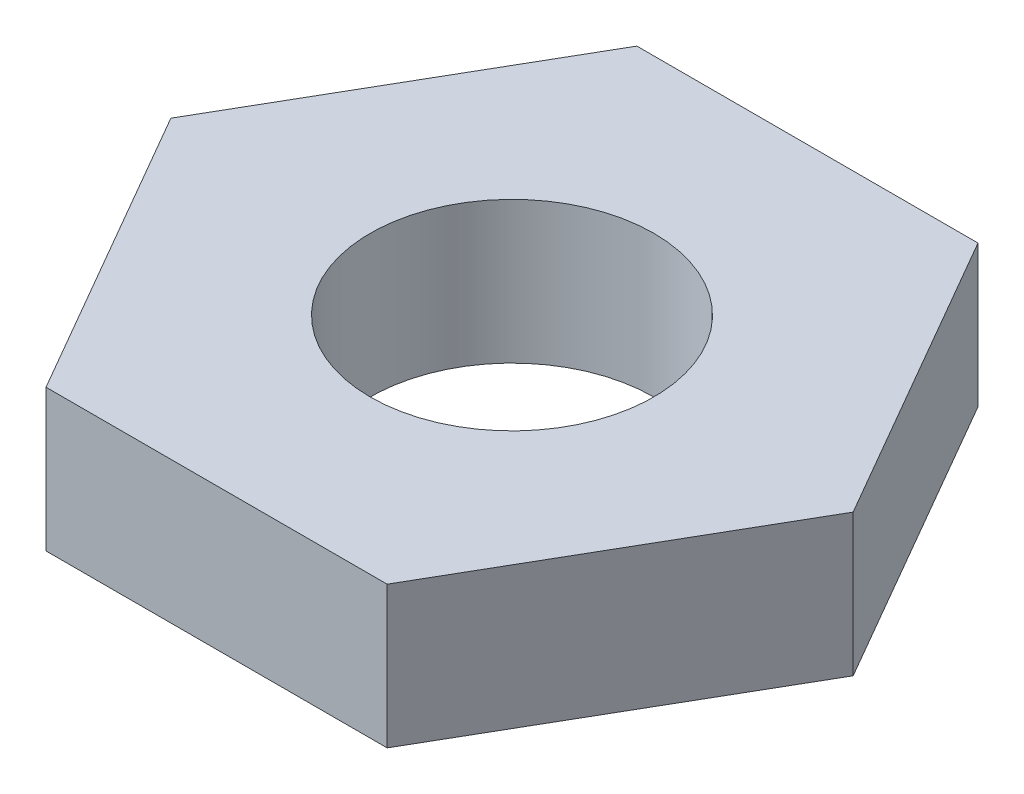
ISO-10303-21;
HEADER;
FILE_DESCRIPTION(('STEP AP214'),'2;1');
FILE_NAME('part.step','',(''),(''),'','','');
FILE_SCHEMA(('AUTOMOTIVE_DESIGN { 1 0 10303 214 1 1 1 1 }'));
ENDSEC;
DATA;
#1=APPLICATION_CONTEXT('core data for automotive mechanical design processes');
#2=APPLICATION_PROTOCOL_DEFINITION('international standard','automotive_design',2000,#1);
#3=PRODUCT_CONTEXT('',#1,'mechanical');
#4=PRODUCT('Part','Part','',(#3));
#5=PRODUCT_RELATED_PRODUCT_CATEGORY('part','',(#4));
#6=PRODUCT_DEFINITION_FORMATION('','',#4);
#7=PRODUCT_DEFINITION_CONTEXT('part definition',#1,'design');
#8=PRODUCT_DEFINITION('design','',#6,#7);
#9=PRODUCT_DEFINITION_SHAPE('','',#8);
#10=(LENGTH_UNIT() NAMED_UNIT(*) SI_UNIT(.MILLI.,.METRE.));
#11=(NAMED_UNIT(*) PLANE_ANGLE_UNIT() SI_UNIT($,.RADIAN.));
#12=(NAMED_UNIT(*) SI_UNIT($,.STERADIAN.) SOLID_ANGLE_UNIT());
#13=UNCERTAINTY_MEASURE_WITH_UNIT(LENGTH_MEASURE(1.E-05),#10,'distance_accuracy_value','');
#14=(GEOMETRIC_REPRESENTATION_CONTEXT(3) GLOBAL_UNCERTAINTY_ASSIGNED_CONTEXT((#13)) GLOBAL_UNIT_ASSIGNED_CONTEXT((#10,
#11,#12)) REPRESENTATION_CONTEXT('',''));
#15=CARTESIAN_POINT('',(0.,0.,0.));
#16=DIRECTION('',(0.,0.,1.));
#17=DIRECTION('',(1.,0.,0.));
#18=AXIS2_PLACEMENT_3D('',#15,#16,#17);
#19=CARTESIAN_POINT('',(21.650635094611,6.,-12.5));
#20=DIRECTION('',(0.,1.,0.));
#21=DIRECTION('',(0.,0.,1.));
#22=AXIS2_PLACEMENT_3D('',#19,#20,#21);
#23=PLANE('',#22);
#24=DIRECTION('',(0.5,0.,-0.866025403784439));
#25=VECTOR('',#24,1.);
#26=CARTESIAN_POINT('',(7.21687836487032,6.,12.5));
#27=LINE('',#26,#25);
#28=CARTESIAN_POINT('',(7.21687836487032,6.,12.5));
#29=VERTEX_POINT('',#28);
#30=CARTESIAN_POINT('',(14.4337567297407,6.,0.));
#31=VERTEX_POINT('',#30);
#32=EDGE_CURVE('E118',#29,#31,#27,.T.);
#33=ORIENTED_EDGE('',*,*,#32,.T.);
#34=DIRECTION('',(-0.5,0.,-0.866025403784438));
#35=VECTOR('',#34,1.);
#36=CARTESIAN_POINT('',(14.4337567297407,6.,0.));
#37=LINE('',#36,#35);
#38=CARTESIAN_POINT('',(7.21687836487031,6.,-12.5));
#39=VERTEX_POINT('',#38);
#40=EDGE_CURVE('E99',#31,#39,#37,.T.);
#41=ORIENTED_EDGE('',*,*,#40,.T.);
#42=DIRECTION('',(-1.,0.,0.));
#43=VECTOR('',#42,1.);
#44=CARTESIAN_POINT('',(7.21687836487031,6.,-12.5));
#45=LINE('',#44,#43);
#46=CARTESIAN_POINT('',(-7.21687836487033,6.,-12.5));
#47=VERTEX_POINT('',#46);
#48=EDGE_CURVE('E121',#39,#47,#45,.T.);
#49=ORIENTED_EDGE('',*,*,#48,.T.);
#50=DIRECTION('',(-0.5,0.,0.866025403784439));
#51=VECTOR('',#50,1.);
#52=CARTESIAN_POINT('',(-7.21687836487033,6.,-12.5));
#53=LINE('',#52,#51);
#54=CARTESIAN_POINT('',(-14.4337567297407,6.,0.));
#55=VERTEX_POINT('',#54);
#56=EDGE_CURVE('E123',#47,#55,#53,.T.);
#57=ORIENTED_EDGE('',*,*,#56,.T.);
#58=DIRECTION('',(0.5,0.,0.866025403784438));
#59=VECTOR('',#58,1.);
#60=CARTESIAN_POINT('',(-14.4337567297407,6.,0.));
#61=LINE('',#60,#59);
#62=CARTESIAN_POINT('',(-7.21687836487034,6.,12.5));
#63=VERTEX_POINT('',#62);
#64=EDGE_CURVE('E52',#55,#63,#61,.T.);
#65=ORIENTED_EDGE('',*,*,#64,.T.);
#66=DIRECTION('',(1.,0.,0.));
#67=VECTOR('',#66,1.);
#68=CARTESIAN_POINT('',(-7.21687836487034,6.,12.5));
#69=LINE('',#68,#67);
#70=EDGE_CURVE('E47',#63,#29,#69,.T.);
#71=ORIENTED_EDGE('',*,*,#70,.T.);
#72=EDGE_LOOP('',(#33,#41,#49,#57,#65,#71));
#73=FACE_BOUND('',#72,.T.);
#74=CARTESIAN_POINT('',(0.,6.,0.));
#75=DIRECTION('',(0.,1.,0.));
#76=DIRECTION('',(0.,0.,1.));
#77=AXIS2_PLACEMENT_3D('',#74,#75,#76);
#78=CIRCLE('',#77,6.);
#79=CARTESIAN_POINT('',(0.,6.,6.));
#80=VERTEX_POINT('',#79);
#81=EDGE_CURVE('E104',#80,#80,#78,.T.);
#82=ORIENTED_EDGE('',*,*,#81,.F.);
#83=EDGE_LOOP('',(#82));
#84=FACE_BOUND('',#83,.T.);
#85=ADVANCED_FACE('F32',(#73,#84),#23,.T.);
#86=CARTESIAN_POINT('',(21.650635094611,0.,-12.5));
#87=DIRECTION('',(0.,1.,0.));
#88=DIRECTION('',(0.,0.,1.));
#89=AXIS2_PLACEMENT_3D('',#86,#87,#88);
#90=PLANE('',#89);
#91=DIRECTION('',(0.5,0.,-0.866025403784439));
#92=VECTOR('',#91,1.);
#93=CARTESIAN_POINT('',(7.21687836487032,0.,12.5));
#94=LINE('',#93,#92);
#95=CARTESIAN_POINT('',(7.21687836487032,0.,12.5));
#96=VERTEX_POINT('',#95);
#97=CARTESIAN_POINT('',(14.4337567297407,0.,0.));
#98=VERTEX_POINT('',#97);
#99=EDGE_CURVE('E90',#96,#98,#94,.T.);
#100=ORIENTED_EDGE('',*,*,#99,.F.);
#101=DIRECTION('',(1.,0.,0.));
#102=VECTOR('',#101,1.);
#103=CARTESIAN_POINT('',(-7.21687836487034,0.,12.5));
#104=LINE('',#103,#102);
#105=CARTESIAN_POINT('',(-7.21687836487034,0.,12.5));
#106=VERTEX_POINT('',#105);
#107=EDGE_CURVE('E116',#106,#96,#104,.T.);
#108=ORIENTED_EDGE('',*,*,#107,.F.);
#109=DIRECTION('',(0.5,0.,0.866025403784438));
#110=VECTOR('',#109,1.);
#111=CARTESIAN_POINT('',(-14.4337567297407,0.,0.));
#112=LINE('',#111,#110);
#113=CARTESIAN_POINT('',(-14.4337567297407,0.,0.));
#114=VERTEX_POINT('',#113);
#115=EDGE_CURVE('E114',#114,#106,#112,.T.);
#116=ORIENTED_EDGE('',*,*,#115,.F.);
#117=DIRECTION('',(-0.5,0.,0.866025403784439));
#118=VECTOR('',#117,1.);
#119=CARTESIAN_POINT('',(-7.21687836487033,0.,-12.5));
#120=LINE('',#119,#118);
#121=CARTESIAN_POINT('',(-7.21687836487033,0.,-12.5));
#122=VERTEX_POINT('',#121);
#123=EDGE_CURVE('E112',#122,#114,#120,.T.);
#124=ORIENTED_EDGE('',*,*,#123,.F.);
#125=DIRECTION('',(-1.,0.,0.));
#126=VECTOR('',#125,1.);
#127=CARTESIAN_POINT('',(7.21687836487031,0.,-12.5));
#128=LINE('',#127,#126);
#129=CARTESIAN_POINT('',(7.21687836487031,0.,-12.5));
#130=VERTEX_POINT('',#129);
#131=EDGE_CURVE('E92',#130,#122,#128,.T.);
#132=ORIENTED_EDGE('',*,*,#131,.F.);
#133=DIRECTION('',(-0.5,0.,-0.866025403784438));
#134=VECTOR('',#133,1.);
#135=CARTESIAN_POINT('',(14.4337567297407,0.,0.));
#136=LINE('',#135,#134);
#137=EDGE_CURVE('E85',#98,#130,#136,.T.);
#138=ORIENTED_EDGE('',*,*,#137,.F.);
#139=EDGE_LOOP('',(#100,#108,#116,#124,#132,#138));
#140=FACE_BOUND('',#139,.T.);
#141=CARTESIAN_POINT('',(0.,0.,0.));
#142=DIRECTION('',(0.,1.,0.));
#143=DIRECTION('',(0.,0.,1.));
#144=AXIS2_PLACEMENT_3D('',#141,#142,#143);
#145=CIRCLE('',#144,6.);
#146=CARTESIAN_POINT('',(0.,0.,6.));
#147=VERTEX_POINT('',#146);
#148=EDGE_CURVE('E107',#147,#147,#145,.T.);
#149=ORIENTED_EDGE('',*,*,#148,.T.);
#150=EDGE_LOOP('',(#149));
#151=FACE_BOUND('',#150,.T.);
#152=ADVANCED_FACE('F86',(#140,#151),#90,.F.);
#153=CARTESIAN_POINT('',(7.21687836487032,6.,12.5));
#154=DIRECTION('',(-0.866025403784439,0.,-0.5));
#155=DIRECTION('',(-0.5,0.,0.866025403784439));
#156=AXIS2_PLACEMENT_3D('',#153,#154,#155);
#157=PLANE('',#156);
#158=ORIENTED_EDGE('',*,*,#99,.T.);
#159=DIRECTION('',(0.,-1.,0.));
#160=VECTOR('',#159,1.);
#161=CARTESIAN_POINT('',(14.4337567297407,6.,0.));
#162=LINE('',#161,#160);
#163=EDGE_CURVE('E11',#31,#98,#162,.T.);
#164=ORIENTED_EDGE('',*,*,#163,.F.);
#165=ORIENTED_EDGE('',*,*,#32,.F.);
#166=DIRECTION('',(0.,-1.,0.));
#167=VECTOR('',#166,1.);
#168=CARTESIAN_POINT('',(7.21687836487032,6.,12.5));
#169=LINE('',#168,#167);
#170=EDGE_CURVE('E103',#29,#96,#169,.T.);
#171=ORIENTED_EDGE('',*,*,#170,.T.);
#172=EDGE_LOOP('',(#158,#164,#165,#171));
#173=FACE_BOUND('',#172,.T.);
#174=ADVANCED_FACE('F34',(#173),#157,.F.);
#175=CARTESIAN_POINT('',(14.4337567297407,6.,0.));
#176=DIRECTION('',(-0.866025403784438,0.,0.5));
#177=DIRECTION('',(0.5,0.,0.866025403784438));
#178=AXIS2_PLACEMENT_3D('',#175,#176,#177);
#179=PLANE('',#178);
#180=ORIENTED_EDGE('',*,*,#137,.T.);
#181=DIRECTION('',(0.,-1.,0.));
#182=VECTOR('',#181,1.);
#183=CARTESIAN_POINT('',(7.21687836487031,6.,-12.5));
#184=LINE('',#183,#182);
#185=EDGE_CURVE('E40',#39,#130,#184,.T.);
#186=ORIENTED_EDGE('',*,*,#185,.F.);
#187=ORIENTED_EDGE('',*,*,#40,.F.);
#188=ORIENTED_EDGE('',*,*,#163,.T.);
#189=EDGE_LOOP('',(#180,#186,#187,#188));
#190=FACE_BOUND('',#189,.T.);
#191=ADVANCED_FACE('F98',(#190),#179,.F.);
#192=CARTESIAN_POINT('',(7.21687836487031,6.,-12.5));
#193=DIRECTION('',(0.,0.,1.));
#194=DIRECTION('',(1.,0.,0.));
#195=AXIS2_PLACEMENT_3D('',#192,#193,#194);
#196=PLANE('',#195);
#197=ORIENTED_EDGE('',*,*,#131,.T.);
#198=DIRECTION('',(0.,-1.,0.));
#199=VECTOR('',#198,1.);
#200=CARTESIAN_POINT('',(-7.21687836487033,6.,-12.5));
#201=LINE('',#200,#199);
#202=EDGE_CURVE('E134',#47,#122,#201,.T.);
#203=ORIENTED_EDGE('',*,*,#202,.F.);
#204=ORIENTED_EDGE('',*,*,#48,.F.);
#205=ORIENTED_EDGE('',*,*,#185,.T.);
#206=EDGE_LOOP('',(#197,#203,#204,#205));
#207=FACE_BOUND('',#206,.T.);
#208=ADVANCED_FACE('F138',(#207),#196,.F.);
#209=CARTESIAN_POINT('',(-7.21687836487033,6.,-12.5));
#210=DIRECTION('',(0.866025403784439,0.,0.5));
#211=DIRECTION('',(0.5,0.,-0.866025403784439));
#212=AXIS2_PLACEMENT_3D('',#209,#210,#211);
#213=PLANE('',#212);
#214=ORIENTED_EDGE('',*,*,#123,.T.);
#215=DIRECTION('',(0.,-1.,0.));
#216=VECTOR('',#215,1.);
#217=CARTESIAN_POINT('',(-14.4337567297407,6.,0.));
#218=LINE('',#217,#216);
#219=EDGE_CURVE('E131',#55,#114,#218,.T.);
#220=ORIENTED_EDGE('',*,*,#219,.F.);
#221=ORIENTED_EDGE('',*,*,#56,.F.);
#222=ORIENTED_EDGE('',*,*,#202,.T.);
#223=EDGE_LOOP('',(#214,#220,#221,#222));
#224=FACE_BOUND('',#223,.T.);
#225=ADVANCED_FACE('F144',(#224),#213,.F.);
#226=CARTESIAN_POINT('',(-14.4337567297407,6.,0.));
#227=DIRECTION('',(0.866025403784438,0.,-0.5));
#228=DIRECTION('',(-0.5,0.,-0.866025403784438));
#229=AXIS2_PLACEMENT_3D('',#226,#227,#228);
#230=PLANE('',#229);
#231=ORIENTED_EDGE('',*,*,#115,.T.);
#232=DIRECTION('',(0.,-1.,0.));
#233=VECTOR('',#232,1.);
#234=CARTESIAN_POINT('',(-7.21687836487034,6.,12.5));
#235=LINE('',#234,#233);
#236=EDGE_CURVE('E128',#63,#106,#235,.T.);
#237=ORIENTED_EDGE('',*,*,#236,.F.);
#238=ORIENTED_EDGE('',*,*,#64,.F.);
#239=ORIENTED_EDGE('',*,*,#219,.T.);
#240=EDGE_LOOP('',(#231,#237,#238,#239));
#241=FACE_BOUND('',#240,.T.);
#242=ADVANCED_FACE('F147',(#241),#230,.F.);
#243=CARTESIAN_POINT('',(-7.21687836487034,6.,12.5));
#244=DIRECTION('',(0.,0.,-1.));
#245=DIRECTION('',(-1.,0.,0.));
#246=AXIS2_PLACEMENT_3D('',#243,#244,#245);
#247=PLANE('',#246);
#248=ORIENTED_EDGE('',*,*,#107,.T.);
#249=ORIENTED_EDGE('',*,*,#170,.F.);
#250=ORIENTED_EDGE('',*,*,#70,.F.);
#251=ORIENTED_EDGE('',*,*,#236,.T.);
#252=EDGE_LOOP('',(#248,#249,#250,#251));
#253=FACE_BOUND('',#252,.T.);
#254=ADVANCED_FACE('F149',(#253),#247,.F.);
#255=CARTESIAN_POINT('',(0.,6.,0.));
#256=DIRECTION('',(0.,-1.,0.));
#257=DIRECTION('',(0.,0.,-1.));
#258=AXIS2_PLACEMENT_3D('',#255,#256,#257);
#259=CYLINDRICAL_SURFACE('',#258,6.);
#260=ORIENTED_EDGE('',*,*,#81,.T.);
#261=EDGE_LOOP('',(#260));
#262=FACE_BOUND('',#261,.T.);
#263=ORIENTED_EDGE('',*,*,#148,.F.);
#264=EDGE_LOOP('',(#263));
#265=FACE_BOUND('',#264,.T.);
#266=ADVANCED_FACE('F151',(#262,#265),#259,.F.);
#267=CLOSED_SHELL('',(#85,#152,#174,#191,#208,#225,#242,#254,#266));
#268=MANIFOLD_SOLID_BREP('B2',#267);
#269=ADVANCED_BREP_SHAPE_REPRESENTATION('',(#18,#268),#14);
#270=SHAPE_DEFINITION_REPRESENTATION(#9,#269);
ENDSEC;
END-ISO-10303-21;
